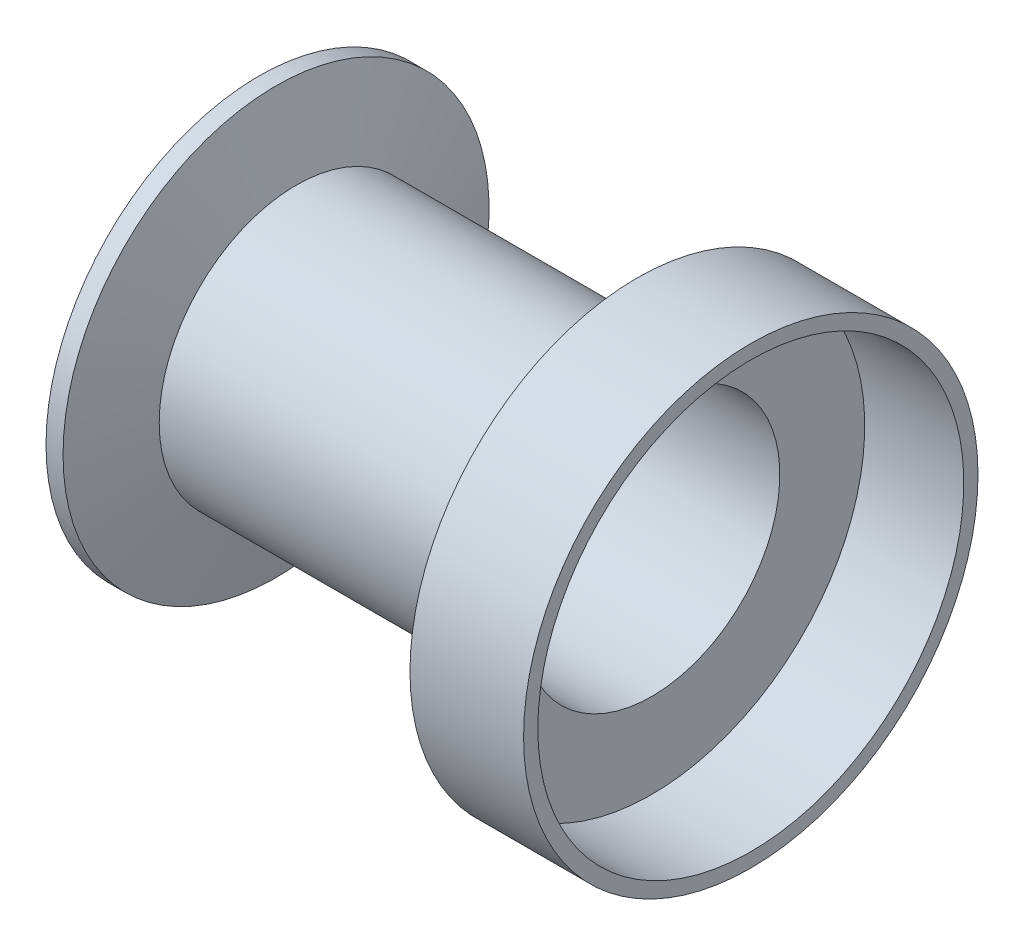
ISO-10303-21;
HEADER;
FILE_DESCRIPTION(('STEP AP214'),'2;1');
FILE_NAME('part.step','',(''),(''),'','','');
FILE_SCHEMA(('AUTOMOTIVE_DESIGN { 1 0 10303 214 1 1 1 1 }'));
ENDSEC;
DATA;
#1=APPLICATION_CONTEXT('core data for automotive mechanical design processes');
#2=APPLICATION_PROTOCOL_DEFINITION('international standard','automotive_design',2000,#1);
#3=PRODUCT_CONTEXT('',#1,'mechanical');
#4=PRODUCT('Part','Part','',(#3));
#5=PRODUCT_RELATED_PRODUCT_CATEGORY('part','',(#4));
#6=PRODUCT_DEFINITION_FORMATION('','',#4);
#7=PRODUCT_DEFINITION_CONTEXT('part definition',#1,'design');
#8=PRODUCT_DEFINITION('design','',#6,#7);
#9=PRODUCT_DEFINITION_SHAPE('','',#8);
#10=(LENGTH_UNIT() NAMED_UNIT(*) SI_UNIT(.MILLI.,.METRE.));
#11=(NAMED_UNIT(*) PLANE_ANGLE_UNIT() SI_UNIT($,.RADIAN.));
#12=(NAMED_UNIT(*) SI_UNIT($,.STERADIAN.) SOLID_ANGLE_UNIT());
#13=UNCERTAINTY_MEASURE_WITH_UNIT(LENGTH_MEASURE(1.E-05),#10,'distance_accuracy_value','');
#14=(GEOMETRIC_REPRESENTATION_CONTEXT(3) GLOBAL_UNCERTAINTY_ASSIGNED_CONTEXT((#13)) GLOBAL_UNIT_ASSIGNED_CONTEXT((#10,
#11,#12)) REPRESENTATION_CONTEXT('',''));
#15=CARTESIAN_POINT('',(0.,0.,0.));
#16=DIRECTION('',(0.,0.,1.));
#17=DIRECTION('',(1.,0.,0.));
#18=AXIS2_PLACEMENT_3D('',#15,#16,#17);
#19=CARTESIAN_POINT('',(6.58,0.,0.));
#20=DIRECTION('',(-1.,0.,0.));
#21=DIRECTION('',(0.,0.,1.));
#22=AXIS2_PLACEMENT_3D('',#19,#20,#21);
#23=CONICAL_SURFACE('',#22,24.15,1.30879579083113);
#24=CARTESIAN_POINT('',(3.,0.,0.));
#25=DIRECTION('',(-1.,0.,0.));
#26=DIRECTION('',(0.,0.,1.));
#27=AXIS2_PLACEMENT_3D('',#24,#25,#26);
#28=CIRCLE('',#27,37.5);
#29=CARTESIAN_POINT('',(3.,0.,37.5));
#30=VERTEX_POINT('',#29);
#31=EDGE_CURVE('E10',#30,#30,#28,.T.);
#32=ORIENTED_EDGE('',*,*,#31,.F.);
#33=EDGE_LOOP('',(#32));
#34=FACE_BOUND('',#33,.T.);
#35=CARTESIAN_POINT('',(6.58,0.,0.));
#36=DIRECTION('',(-1.,0.,0.));
#37=DIRECTION('',(0.,0.,1.));
#38=AXIS2_PLACEMENT_3D('',#35,#36,#37);
#39=CIRCLE('',#38,24.15);
#40=CARTESIAN_POINT('',(6.58,0.,24.15));
#41=VERTEX_POINT('',#40);
#42=EDGE_CURVE('E69',#41,#41,#39,.T.);
#43=ORIENTED_EDGE('',*,*,#42,.T.);
#44=EDGE_LOOP('',(#43));
#45=FACE_BOUND('',#44,.T.);
#46=ADVANCED_FACE('F29',(#34,#45),#23,.T.);
#47=CARTESIAN_POINT('',(0.,0.,0.));
#48=DIRECTION('',(-1.,0.,0.));
#49=DIRECTION('',(0.,0.,1.));
#50=AXIS2_PLACEMENT_3D('',#47,#48,#49);
#51=CYLINDRICAL_SURFACE('',#50,37.5);
#52=CARTESIAN_POINT('',(0.,0.,0.));
#53=DIRECTION('',(-1.,0.,0.));
#54=DIRECTION('',(0.,0.,1.));
#55=AXIS2_PLACEMENT_3D('',#52,#53,#54);
#56=CIRCLE('',#55,37.5);
#57=CARTESIAN_POINT('',(0.,0.,37.5));
#58=VERTEX_POINT('',#57);
#59=EDGE_CURVE('E35',#58,#58,#56,.T.);
#60=ORIENTED_EDGE('',*,*,#59,.F.);
#61=EDGE_LOOP('',(#60));
#62=FACE_BOUND('',#61,.T.);
#63=ORIENTED_EDGE('',*,*,#31,.T.);
#64=EDGE_LOOP('',(#63));
#65=FACE_BOUND('',#64,.T.);
#66=ADVANCED_FACE('F130',(#62,#65),#51,.T.);
#67=CARTESIAN_POINT('',(0.,26.15,0.));
#68=DIRECTION('',(1.,0.,0.));
#69=DIRECTION('',(0.,0.,-1.));
#70=AXIS2_PLACEMENT_3D('',#67,#68,#69);
#71=PLANE('',#70);
#72=CARTESIAN_POINT('',(0.,0.,0.));
#73=DIRECTION('',(-1.,0.,0.));
#74=DIRECTION('',(0.,0.,1.));
#75=AXIS2_PLACEMENT_3D('',#72,#73,#74);
#76=CIRCLE('',#75,26.15);
#77=CARTESIAN_POINT('',(0.,0.,26.15));
#78=VERTEX_POINT('',#77);
#79=EDGE_CURVE('E39',#78,#78,#76,.T.);
#80=ORIENTED_EDGE('',*,*,#79,.F.);
#81=EDGE_LOOP('',(#80));
#82=FACE_BOUND('',#81,.T.);
#83=ORIENTED_EDGE('',*,*,#59,.T.);
#84=EDGE_LOOP('',(#83));
#85=FACE_BOUND('',#84,.T.);
#86=ADVANCED_FACE('F125',(#82,#85),#71,.F.);
#87=CARTESIAN_POINT('',(0.,0.,0.));
#88=DIRECTION('',(-1.,0.,0.));
#89=DIRECTION('',(0.,0.,1.));
#90=AXIS2_PLACEMENT_3D('',#87,#88,#89);
#91=CYLINDRICAL_SURFACE('',#90,26.15);
#92=CARTESIAN_POINT('',(2.5,0.,0.));
#93=DIRECTION('',(-1.,0.,0.));
#94=DIRECTION('',(0.,0.,1.));
#95=AXIS2_PLACEMENT_3D('',#92,#93,#94);
#96=CIRCLE('',#95,26.15);
#97=CARTESIAN_POINT('',(2.5,0.,26.15));
#98=VERTEX_POINT('',#97);
#99=EDGE_CURVE('E43',#98,#98,#96,.T.);
#100=ORIENTED_EDGE('',*,*,#99,.F.);
#101=EDGE_LOOP('',(#100));
#102=FACE_BOUND('',#101,.T.);
#103=ORIENTED_EDGE('',*,*,#79,.T.);
#104=EDGE_LOOP('',(#103));
#105=FACE_BOUND('',#104,.T.);
#106=ADVANCED_FACE('F119',(#102,#105),#91,.F.);
#107=CARTESIAN_POINT('',(2.5,26.15,0.));
#108=DIRECTION('',(1.,0.,0.));
#109=DIRECTION('',(0.,0.,-1.));
#110=AXIS2_PLACEMENT_3D('',#107,#108,#109);
#111=PLANE('',#110);
#112=CARTESIAN_POINT('',(2.5,0.,0.));
#113=DIRECTION('',(-1.,0.,0.));
#114=DIRECTION('',(0.,0.,1.));
#115=AXIS2_PLACEMENT_3D('',#112,#113,#114);
#116=CIRCLE('',#115,22.55);
#117=CARTESIAN_POINT('',(2.5,0.,22.55));
#118=VERTEX_POINT('',#117);
#119=EDGE_CURVE('E48',#118,#118,#116,.T.);
#120=ORIENTED_EDGE('',*,*,#119,.F.);
#121=EDGE_LOOP('',(#120));
#122=FACE_BOUND('',#121,.T.);
#123=ORIENTED_EDGE('',*,*,#99,.T.);
#124=EDGE_LOOP('',(#123));
#125=FACE_BOUND('',#124,.T.);
#126=ADVANCED_FACE('F113',(#122,#125),#111,.F.);
#127=CARTESIAN_POINT('',(0.,0.,0.));
#128=DIRECTION('',(-1.,0.,0.));
#129=DIRECTION('',(0.,0.,1.));
#130=AXIS2_PLACEMENT_3D('',#127,#128,#129);
#131=CYLINDRICAL_SURFACE('',#130,22.55);
#132=CARTESIAN_POINT('',(69.14,0.,0.));
#133=DIRECTION('',(-1.,0.,0.));
#134=DIRECTION('',(0.,0.,1.));
#135=AXIS2_PLACEMENT_3D('',#132,#133,#134);
#136=CIRCLE('',#135,22.55);
#137=CARTESIAN_POINT('',(69.14,0.,22.55));
#138=VERTEX_POINT('',#137);
#139=EDGE_CURVE('E51',#138,#138,#136,.T.);
#140=ORIENTED_EDGE('',*,*,#139,.F.);
#141=EDGE_LOOP('',(#140));
#142=FACE_BOUND('',#141,.T.);
#143=ORIENTED_EDGE('',*,*,#119,.T.);
#144=EDGE_LOOP('',(#143));
#145=FACE_BOUND('',#144,.T.);
#146=ADVANCED_FACE('F107',(#142,#145),#131,.F.);
#147=CARTESIAN_POINT('',(69.14,37.5,0.));
#148=DIRECTION('',(-1.,0.,0.));
#149=DIRECTION('',(0.,0.,1.));
#150=AXIS2_PLACEMENT_3D('',#147,#148,#149);
#151=PLANE('',#150);
#152=CARTESIAN_POINT('',(69.14,0.,0.));
#153=DIRECTION('',(-1.,0.,0.));
#154=DIRECTION('',(0.,0.,1.));
#155=AXIS2_PLACEMENT_3D('',#152,#153,#154);
#156=CIRCLE('',#155,37.5);
#157=CARTESIAN_POINT('',(69.14,0.,37.5));
#158=VERTEX_POINT('',#157);
#159=EDGE_CURVE('E54',#158,#158,#156,.T.);
#160=ORIENTED_EDGE('',*,*,#159,.F.);
#161=EDGE_LOOP('',(#160));
#162=FACE_BOUND('',#161,.T.);
#163=ORIENTED_EDGE('',*,*,#139,.T.);
#164=EDGE_LOOP('',(#163));
#165=FACE_BOUND('',#164,.T.);
#166=ADVANCED_FACE('F101',(#162,#165),#151,.F.);
#167=CARTESIAN_POINT('',(0.,0.,0.));
#168=DIRECTION('',(-1.,0.,0.));
#169=DIRECTION('',(0.,0.,1.));
#170=AXIS2_PLACEMENT_3D('',#167,#168,#169);
#171=CYLINDRICAL_SURFACE('',#170,37.5);
#172=CARTESIAN_POINT('',(86.58,0.,0.));
#173=DIRECTION('',(-1.,0.,0.));
#174=DIRECTION('',(0.,0.,1.));
#175=AXIS2_PLACEMENT_3D('',#172,#173,#174);
#176=CIRCLE('',#175,37.5);
#177=CARTESIAN_POINT('',(86.58,0.,37.5));
#178=VERTEX_POINT('',#177);
#179=EDGE_CURVE('E57',#178,#178,#176,.T.);
#180=ORIENTED_EDGE('',*,*,#179,.F.);
#181=EDGE_LOOP('',(#180));
#182=FACE_BOUND('',#181,.T.);
#183=ORIENTED_EDGE('',*,*,#159,.T.);
#184=EDGE_LOOP('',(#183));
#185=FACE_BOUND('',#184,.T.);
#186=ADVANCED_FACE('F95',(#182,#185),#171,.F.);
#187=CARTESIAN_POINT('',(86.58,40.,0.));
#188=DIRECTION('',(-1.,0.,0.));
#189=DIRECTION('',(0.,0.,1.));
#190=AXIS2_PLACEMENT_3D('',#187,#188,#189);
#191=PLANE('',#190);
#192=CARTESIAN_POINT('',(86.58,0.,0.));
#193=DIRECTION('',(-1.,0.,0.));
#194=DIRECTION('',(0.,0.,1.));
#195=AXIS2_PLACEMENT_3D('',#192,#193,#194);
#196=CIRCLE('',#195,40.);
#197=CARTESIAN_POINT('',(86.58,0.,40.));
#198=VERTEX_POINT('',#197);
#199=EDGE_CURVE('E60',#198,#198,#196,.T.);
#200=ORIENTED_EDGE('',*,*,#199,.F.);
#201=EDGE_LOOP('',(#200));
#202=FACE_BOUND('',#201,.T.);
#203=ORIENTED_EDGE('',*,*,#179,.T.);
#204=EDGE_LOOP('',(#203));
#205=FACE_BOUND('',#204,.T.);
#206=ADVANCED_FACE('F89',(#202,#205),#191,.F.);
#207=CARTESIAN_POINT('',(0.,0.,0.));
#208=DIRECTION('',(-1.,0.,0.));
#209=DIRECTION('',(0.,0.,1.));
#210=AXIS2_PLACEMENT_3D('',#207,#208,#209);
#211=CYLINDRICAL_SURFACE('',#210,40.);
#212=CARTESIAN_POINT('',(66.58,0.,0.));
#213=DIRECTION('',(-1.,0.,0.));
#214=DIRECTION('',(0.,0.,1.));
#215=AXIS2_PLACEMENT_3D('',#212,#213,#214);
#216=CIRCLE('',#215,40.);
#217=CARTESIAN_POINT('',(66.58,0.,40.));
#218=VERTEX_POINT('',#217);
#219=EDGE_CURVE('E63',#218,#218,#216,.T.);
#220=ORIENTED_EDGE('',*,*,#219,.F.);
#221=EDGE_LOOP('',(#220));
#222=FACE_BOUND('',#221,.T.);
#223=ORIENTED_EDGE('',*,*,#199,.T.);
#224=EDGE_LOOP('',(#223));
#225=FACE_BOUND('',#224,.T.);
#226=ADVANCED_FACE('F83',(#222,#225),#211,.T.);
#227=CARTESIAN_POINT('',(66.58,24.15,0.));
#228=DIRECTION('',(1.,0.,0.));
#229=DIRECTION('',(0.,0.,-1.));
#230=AXIS2_PLACEMENT_3D('',#227,#228,#229);
#231=PLANE('',#230);
#232=CARTESIAN_POINT('',(66.58,0.,0.));
#233=DIRECTION('',(-1.,0.,0.));
#234=DIRECTION('',(0.,0.,1.));
#235=AXIS2_PLACEMENT_3D('',#232,#233,#234);
#236=CIRCLE('',#235,24.15);
#237=CARTESIAN_POINT('',(66.58,0.,24.15));
#238=VERTEX_POINT('',#237);
#239=EDGE_CURVE('E66',#238,#238,#236,.T.);
#240=ORIENTED_EDGE('',*,*,#239,.F.);
#241=EDGE_LOOP('',(#240));
#242=FACE_BOUND('',#241,.T.);
#243=ORIENTED_EDGE('',*,*,#219,.T.);
#244=EDGE_LOOP('',(#243));
#245=FACE_BOUND('',#244,.T.);
#246=ADVANCED_FACE('F77',(#242,#245),#231,.F.);
#247=CARTESIAN_POINT('',(0.,0.,0.));
#248=DIRECTION('',(-1.,0.,0.));
#249=DIRECTION('',(0.,0.,1.));
#250=AXIS2_PLACEMENT_3D('',#247,#248,#249);
#251=CYLINDRICAL_SURFACE('',#250,24.15);
#252=ORIENTED_EDGE('',*,*,#42,.F.);
#253=EDGE_LOOP('',(#252));
#254=FACE_BOUND('',#253,.T.);
#255=ORIENTED_EDGE('',*,*,#239,.T.);
#256=EDGE_LOOP('',(#255));
#257=FACE_BOUND('',#256,.T.);
#258=ADVANCED_FACE('F74',(#254,#257),#251,.T.);
#259=CLOSED_SHELL('',(#46,#66,#86,#106,#126,#146,#166,#186,#206,#226,#246,#258));
#260=MANIFOLD_SOLID_BREP('B2',#259);
#261=ADVANCED_BREP_SHAPE_REPRESENTATION('',(#18,#260),#14);
#262=SHAPE_DEFINITION_REPRESENTATION(#9,#261);
ENDSEC;
END-ISO-10303-21;
